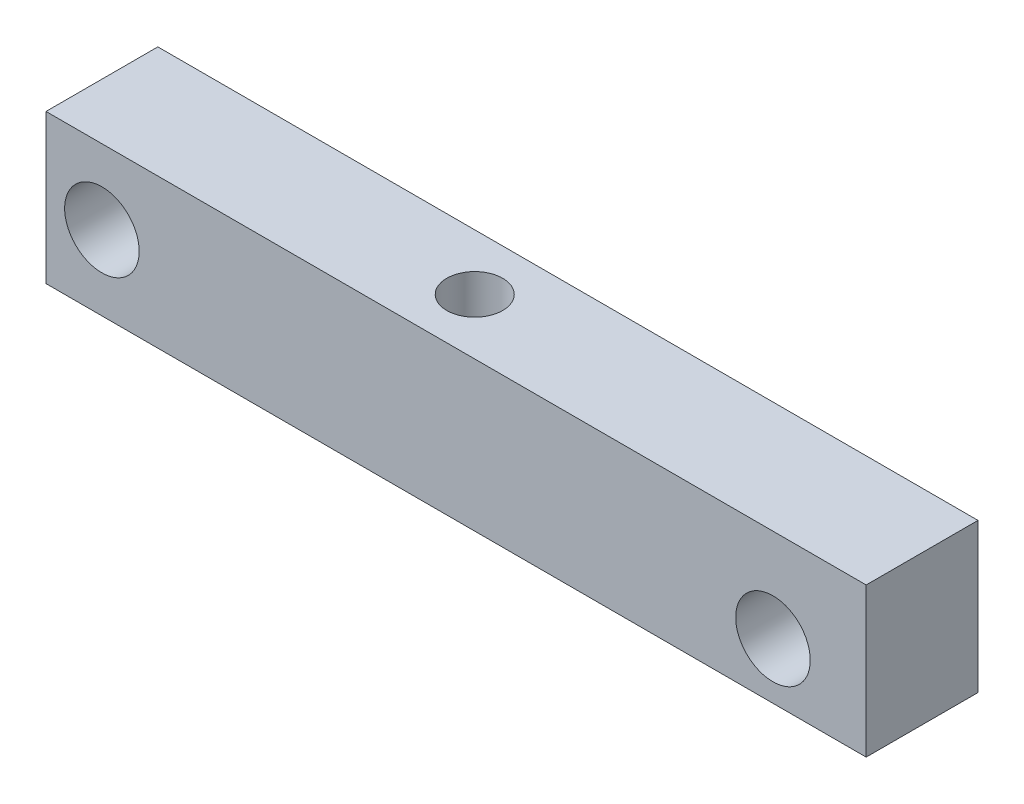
from build123d import *

# Parameters (mm, degrees)
CROQUIS1_W              = 22
CROQUIS1_H              = 4
SALIENTE_EXTRUIR1_DEPTH = 3
CROQUIS2_R              = 0.75
CORTAR_EXTRUIR1_DEPTH   = 3
CORTAR_EXTRUIR2_REACH   = 13.576
CROQUIS3_R              = 1


with BuildPart() as part:
    # Croquis1 → Saliente-Extruir1 (new body)
    with BuildSketch(Plane.XY):
        Rectangle(CROQUIS1_W, CROQUIS1_H)
    extrude(amount=SALIENTE_EXTRUIR1_DEPTH)

    # Croquis2 → Cortar-Extruir1 (cut)
    with BuildSketch(Plane(origin=(0, 2, 0), x_dir=(1, 0, 0), z_dir=(0, 1, 0))):
        with Locations(Location((-1, -1.5, 0), (0, 0, 270))):
            Circle(CROQUIS2_R)
    extrude(amount=-CORTAR_EXTRUIR1_DEPTH, mode=Mode.SUBTRACT)

    # Croquis3 → Cortar-Extruir2 (cut, up to next)
    with BuildSketch(Plane.XY.offset(3), mode=Mode.PRIVATE) as cortar_extruir2_sk1:
        with Locations((8.5, -0.5)):
            Circle(CROQUIS3_R)
    cortar_extruir2_tool1 = extrude(cortar_extruir2_sk1.sketch, amount=-CORTAR_EXTRUIR2_REACH, mode=Mode.PRIVATE) & part.part
    # Croquis3 → Cortar-Extruir2 (cut, up to next)
    with BuildSketch(Plane.XY.offset(3), mode=Mode.PRIVATE) as cortar_extruir2_sk2:
        with Locations((-9.5, 0)):
            Circle(CROQUIS3_R)
    cortar_extruir2_tool2 = extrude(cortar_extruir2_sk2.sketch, amount=-CORTAR_EXTRUIR2_REACH, mode=Mode.PRIVATE) & part.part
    add(cortar_extruir2_tool1.solids().sort_by_distance((8.5, -0.5, 3))[0], mode=Mode.SUBTRACT)
    add(cortar_extruir2_tool2.solids().sort_by_distance((-9.5, 0, 3))[0], mode=Mode.SUBTRACT)


solid = part.part
